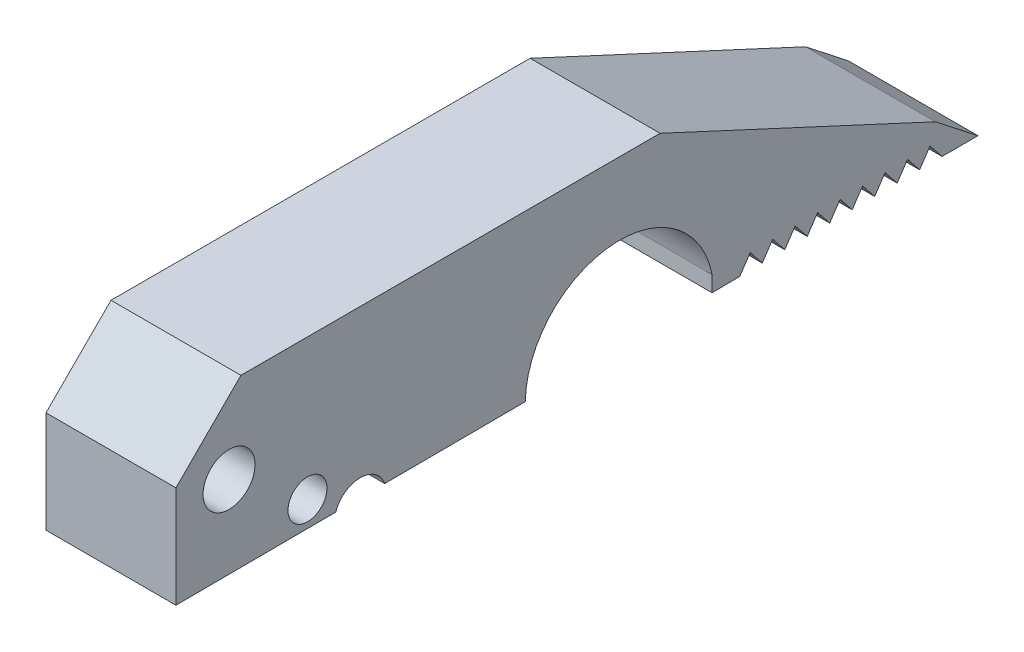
from build123d import *

# Parameters (mm, degrees)
SKETCH3_R           = 2
SKETCH3_R_2         = 1.5
BOSS_EXTRUDE3_DEPTH = 10
CHAMFER1_SIZE       = 5


with BuildPart() as part:
    # Sketch3 → Boss-Extrude3 (new body)
    with BuildSketch(Plane(origin=(0, 0, 0), x_dir=(0, 0, -1), z_dir=(1, 0, 0))):
        with BuildLine():
            Line((-10.790231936, 1.418662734), (-10.790231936, 11.418662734))
            Line((-10.790231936, 11.418662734), (26.465432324, 11.418662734))
            Line((26.465432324, 11.418662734), (47.651644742, 1.593543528))
            Line((47.651644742, 1.593543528), (50.931652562, -0.974612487))
            Line((50.931652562, -0.974612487), (48.427285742, -0.974612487))
            Line((48.427285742, -0.974612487), (48.169984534, -0.978050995))
            Line((48.169984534, -0.978050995), (47.242194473, 0.187740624))
            Line((47.242194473, 0.187740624), (46.440138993, -1.001168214))
            Line((46.440138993, -1.001168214), (45.512348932, 0.164623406))
            Line((45.512348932, 0.164623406), (44.710293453, -1.024285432))
            Line((44.710293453, -1.024285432), (43.782503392, 0.141506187))
            Line((43.782503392, 0.141506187), (42.980447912, -1.047402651))
            Line((42.980447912, -1.047402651), (42.052657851, 0.118388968))
            Line((42.052657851, 0.118388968), (41.250602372, -1.07051987))
            Line((41.250602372, -1.07051987), (40.322812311, 0.09527175))
            Line((40.322812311, 0.09527175), (39.520756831, -1.093637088))
            Line((39.520756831, -1.093637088), (38.59296677, 0.072154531))
            Line((38.59296677, 0.072154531), (37.79091129, -1.116754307))
            Line((37.79091129, -1.116754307), (36.863038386, 0.049141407))
            Line((36.863038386, 0.049141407), (36.06091129, -1.13987359))
            Line((36.06091129, -1.13987359), (35.133038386, 0.026022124))
            Line((35.133038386, 0.026022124), (34.33091129, -1.162992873))
            Line((34.33091129, -1.162992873), (33.403038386, 0.002902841))
            Line((33.403038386, 0.002902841), (32.60091129, -1.186112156))
            Line((32.60091129, -1.186112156), (30.470279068, -1.214585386))
            Line((30.470279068, -1.214585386), (30.470293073, 0.000354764))
            ThreePointArc((30.470293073, 0.000354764), (22.704945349, 5.823037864), (16.092145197, -1.281547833))
            Line((16.092145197, -1.281547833), (5.27884494, -1.331907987))
            ThreePointArc((5.27884494, -1.331907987), (4.547850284, -0.366256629), (3.393571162, 0.000452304))
            ThreePointArc((3.393571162, 0.000452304), (2.231698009, -0.371650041), (1.50216058, -1.34949692))
            Line((1.50216058, -1.34949692), (-10.790231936, -1.406745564))
            Line((-10.790231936, -1.406745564), (-10.790231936, 1.418662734))
        make_face()
        with Locations((-6.703469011, 4.934973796)):
            Circle(SKETCH3_R, mode=Mode.SUBTRACT)
        with Locations((-0.667060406, 0.593254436)):
            Circle(SKETCH3_R_2, mode=Mode.SUBTRACT)
    extrude(amount=BOSS_EXTRUDE3_DEPTH)

    # Chamfer1
    chamfer1_edges = [part.edges().sort_by_distance(p)[0] for p in [
        (5, 11.418662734, 10.790231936),
    ]]
    chamfer(chamfer1_edges, length=CHAMFER1_SIZE)


solid = part.part
